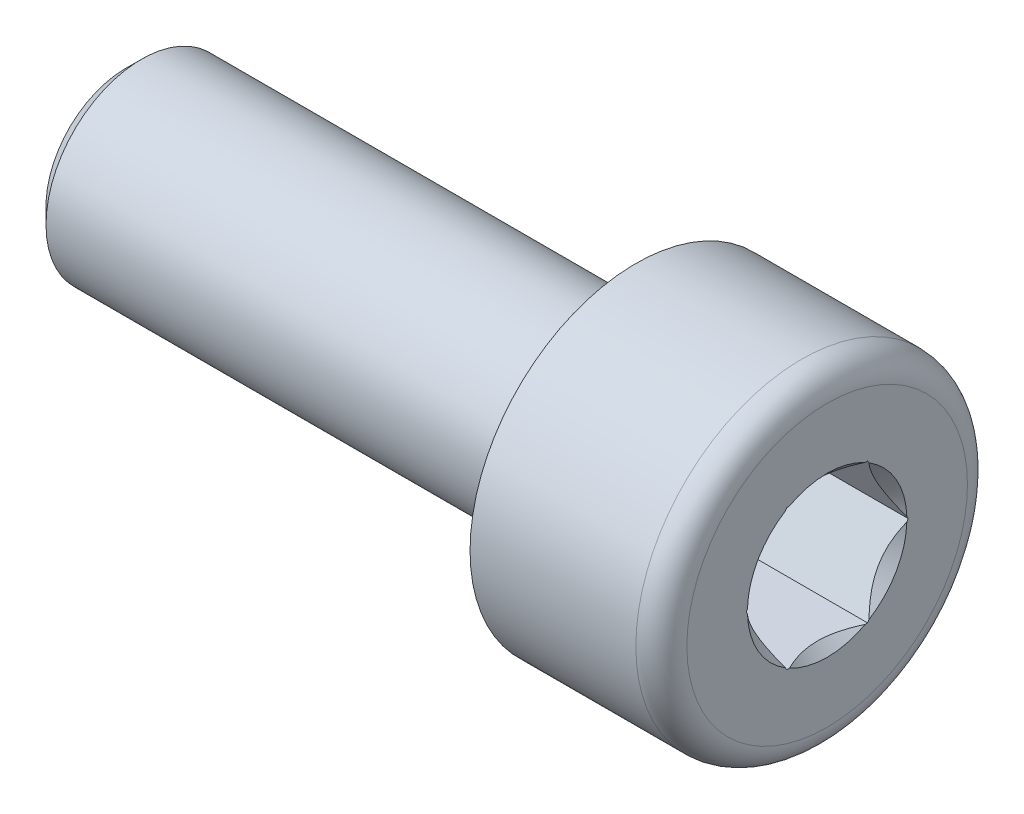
from build123d import *

# Parameters (mm, degrees)
CHANFREIN1_SIZE         = 0.25
ENL_V_MAT_EXTRU_1_DEPTH = 2


with BuildPart() as part:
    # Esquisse1 → Base-R_volution (revolve)
    with BuildSketch(Plane.XY, mode=Mode.PRIVATE) as base_r_volution_sk:
        with BuildLine():
            Line((0, 1.5), (0, 2.6))
            Line((0, 2.6), (2.6, 2.6))
            ThreePointArc((2.6, 2.6), (2.882842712, 2.482842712), (3, 2.2))
            Line((3, 2.2), (3, 1.25))
            Line((3, 1.25), (2.75, 1))
            Line((2.75, 1), (1, 1))
            Line((1, 1), (0.422649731, 0))
            Line((0.422649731, 0), (-8, 0))
            Line((-8, 0), (-8, 1.5))
            Line((-8, 1.5), (0, 1.5))
        make_face()
    revolve(base_r_volution_sk.sketch.rotate(Axis((-30, 0, 0), (1, 0, 0)), 90), axis=Axis((-30, 0, 0), (1, 0, 0)))

    # Chanfrein1
    chanfrein1_edges = [part.edges().sort_by_distance(p)[0] for p in [
        (-8, 0, -1.5),
    ]]
    chamfer(chanfrein1_edges, length=CHANFREIN1_SIZE)

    # Esquisse2 → Enl_v. mat.-Extru.1 (cut)
    with BuildSketch(Plane(origin=(3, 0, 0), x_dir=(0, 0, -1), z_dir=(1, 0, 0))):
        Polygon((-1.270170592, 0), (-0.635085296, -1.1), (0.635085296, -1.1), (1.270170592, 0), (0.635085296, 1.1), (-0.635085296, 1.1), align=None)
    extrude(amount=-ENL_V_MAT_EXTRU_1_DEPTH, mode=Mode.SUBTRACT)


solid = part.part
